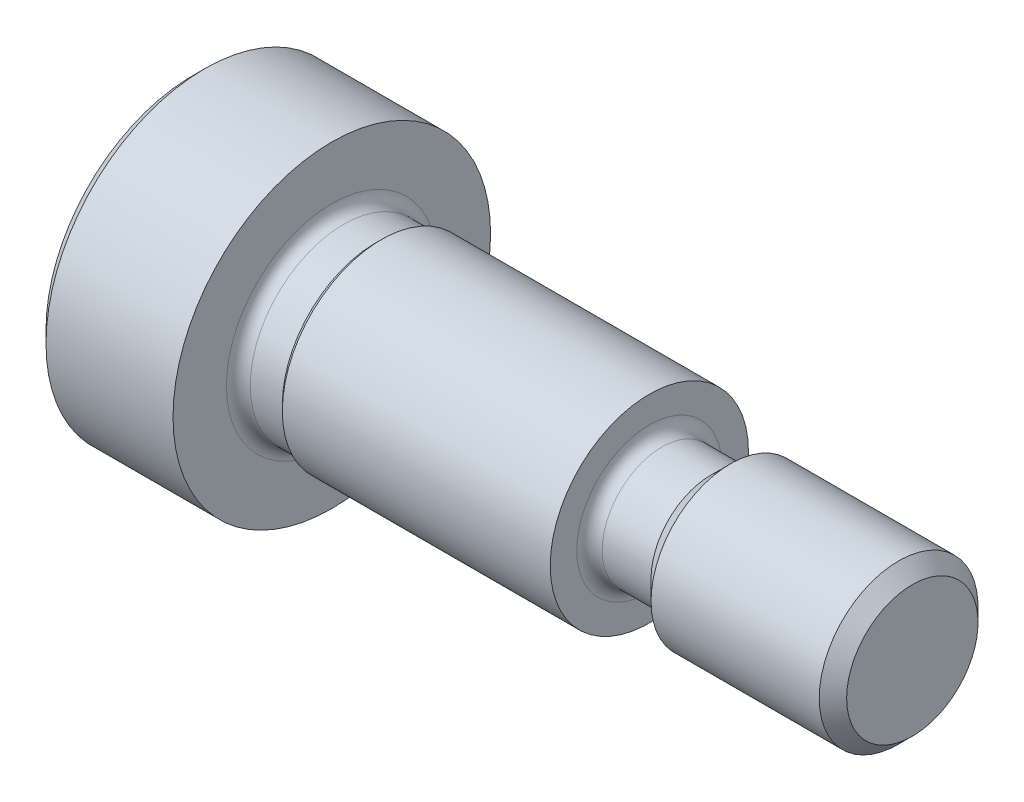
from build123d import *

# Parameters (mm, degrees)
CHAMFER1_SIZE = 0.6
HEX_2_DEPTH   = 4.2


with BuildPart() as part:
    # BodySke → BaseBody (revolve)
    with BuildSketch(Plane.XY, mode=Mode.PRIVATE) as basebody_sk:
        with BuildLine():
            Line((0, 0), (0, 8))
            Line((0, 8), (7, 8))
            Line((7, 8), (7, 5.31))
            ThreePointArc((7, 5.31), (7.175735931, 4.885735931), (7.6, 4.71))
            Line((7.6, 4.71), (9.2165, 4.71))
            Line((9.2165, 4.71), (9.5, 4.9935))
            Line((9.5, 4.9935), (23, 4.9935))
            Line((23, 4.9935), (23, 3.655))
            ThreePointArc((23, 3.655), (23.18745166, 3.20245166), (23.64, 3.015))
            Line((23.64, 3.015), (26.1, 3.015))
            Line((26.1, 3.015), (27.085, 4))
            Line((27.085, 4), (35.5595, 4))
            Line((35.5595, 4), (36.25, 3.3095))
            Line((36.25, 3.3095), (36.25, 0))
            Line((36.25, 0), (0, 0))
        make_face()
    revolve(basebody_sk.sketch.rotate(Axis((-6.35, 0, 0), (1, 0, 0)), 90), axis=Axis((-6.35, 0, 0), (1, 0, 0)))

    # Chamfer1
    chamfer1_edges = [part.edges().sort_by_distance(p)[0] for p in [
        (0, 0, -8),
    ]]
    chamfer(chamfer1_edges, length=CHAMFER1_SIZE)

    # Sketch2 → PreBroach (revolve, cut)
    with BuildSketch(Plane.XY, mode=Mode.PRIVATE) as prebroach_sk:
        Polygon((0, 2.5475), (4.2, 2.5475), (5.670799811, 0), (0, 0), align=None)
    revolve(prebroach_sk.sketch.rotate(Axis((0, 0, 0), (1, 0, 0)), 90), axis=Axis((0, 0, 0), (1, 0, 0)), mode=Mode.SUBTRACT)

    # Sketch3 → Hex 2 (cut)
    with BuildSketch(Plane.ZY):
        Polygon((-2.5475, -1.470799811), (-2.5475, 1.470799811), (0, 2.941599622), (2.5475, 1.470799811), (2.5475, -1.470799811), (0, -2.941599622), align=None)
    extrude(amount=-HEX_2_DEPTH, mode=Mode.SUBTRACT)


solid = part.part
